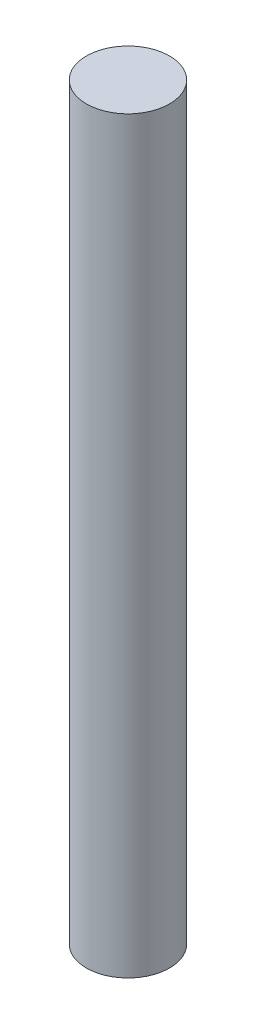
from build123d import *

# Parameters (mm, degrees)
SKETCH1_R      = 24.257
EXTRUDE1_DEPTH = 436.88


with BuildPart() as part:
    # Sketch1 → Extrude1 (new body)
    with BuildSketch(Plane(origin=(0, 0, 0), x_dir=(1, 0, 0), z_dir=(0, 1, 0))):
        with Locations(Location((0, 0, 0), (0, 0, 270))):
            Circle(SKETCH1_R)
    extrude(amount=EXTRUDE1_DEPTH)


solid = part.part
